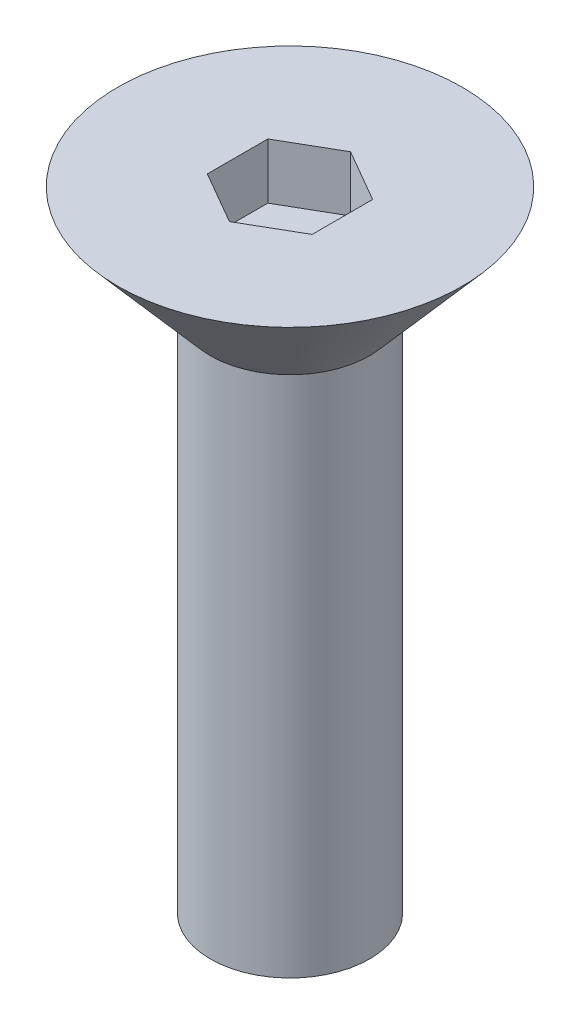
ISO-10303-21;
HEADER;
FILE_DESCRIPTION(('STEP AP214'),'2;1');
FILE_NAME('part.step','',(''),(''),'','','');
FILE_SCHEMA(('AUTOMOTIVE_DESIGN { 1 0 10303 214 1 1 1 1 }'));
ENDSEC;
DATA;
#1=APPLICATION_CONTEXT('core data for automotive mechanical design processes');
#2=APPLICATION_PROTOCOL_DEFINITION('international standard','automotive_design',2000,#1);
#3=PRODUCT_CONTEXT('',#1,'mechanical');
#4=PRODUCT('Part','Part','',(#3));
#5=PRODUCT_RELATED_PRODUCT_CATEGORY('part','',(#4));
#6=PRODUCT_DEFINITION_FORMATION('','',#4);
#7=PRODUCT_DEFINITION_CONTEXT('part definition',#1,'design');
#8=PRODUCT_DEFINITION('design','',#6,#7);
#9=PRODUCT_DEFINITION_SHAPE('','',#8);
#10=(LENGTH_UNIT() NAMED_UNIT(*) SI_UNIT(.MILLI.,.METRE.));
#11=(NAMED_UNIT(*) PLANE_ANGLE_UNIT() SI_UNIT($,.RADIAN.));
#12=(NAMED_UNIT(*) SI_UNIT($,.STERADIAN.) SOLID_ANGLE_UNIT());
#13=UNCERTAINTY_MEASURE_WITH_UNIT(LENGTH_MEASURE(1.E-05),#10,'distance_accuracy_value','');
#14=(GEOMETRIC_REPRESENTATION_CONTEXT(3) GLOBAL_UNCERTAINTY_ASSIGNED_CONTEXT((#13)) GLOBAL_UNIT_ASSIGNED_CONTEXT((#10,
#11,#12)) REPRESENTATION_CONTEXT('',''));
#15=CARTESIAN_POINT('',(0.,0.,0.));
#16=DIRECTION('',(0.,0.,1.));
#17=DIRECTION('',(1.,0.,0.));
#18=AXIS2_PLACEMENT_3D('',#15,#16,#17);
#19=CARTESIAN_POINT('',(0.,0.,0.));
#20=DIRECTION('',(0.,1.,0.));
#21=DIRECTION('',(0.,0.,1.));
#22=AXIS2_PLACEMENT_3D('',#19,#20,#21);
#23=PLANE('',#22);
#24=DIRECTION('',(0.,0.,1.));
#25=VECTOR('',#24,1.);
#26=CARTESIAN_POINT('',(-1.5875,0.,-0.916543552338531));
#27=LINE('',#26,#25);
#28=CARTESIAN_POINT('',(-1.5875,0.,-0.916543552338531));
#29=VERTEX_POINT('',#28);
#30=CARTESIAN_POINT('',(-1.5875,0.,0.91654355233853));
#31=VERTEX_POINT('',#30);
#32=EDGE_CURVE('E50',#29,#31,#27,.T.);
#33=ORIENTED_EDGE('',*,*,#32,.F.);
#34=DIRECTION('',(-0.866025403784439,0.,0.5));
#35=VECTOR('',#34,1.);
#36=CARTESIAN_POINT('',(0.,0.,-1.83308710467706));
#37=LINE('',#36,#35);
#38=CARTESIAN_POINT('',(0.,0.,-1.83308710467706));
#39=VERTEX_POINT('',#38);
#40=EDGE_CURVE('E134',#39,#29,#37,.T.);
#41=ORIENTED_EDGE('',*,*,#40,.F.);
#42=DIRECTION('',(0.866025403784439,0.,0.5));
#43=VECTOR('',#42,1.);
#44=CARTESIAN_POINT('',(0.,0.,-1.83308710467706));
#45=LINE('',#44,#43);
#46=CARTESIAN_POINT('',(1.5875,0.,-0.916543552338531));
#47=VERTEX_POINT('',#46);
#48=EDGE_CURVE('E132',#39,#47,#45,.T.);
#49=ORIENTED_EDGE('',*,*,#48,.T.);
#50=DIRECTION('',(0.,0.,1.));
#51=VECTOR('',#50,1.);
#52=CARTESIAN_POINT('',(1.5875,0.,-0.916543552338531));
#53=LINE('',#52,#51);
#54=CARTESIAN_POINT('',(1.5875,0.,0.91654355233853));
#55=VERTEX_POINT('',#54);
#56=EDGE_CURVE('E109',#47,#55,#53,.T.);
#57=ORIENTED_EDGE('',*,*,#56,.T.);
#58=DIRECTION('',(0.86602540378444,0.,-0.499999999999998));
#59=VECTOR('',#58,1.);
#60=CARTESIAN_POINT('',(0.,0.,1.83308710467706));
#61=LINE('',#60,#59);
#62=CARTESIAN_POINT('',(0.,0.,1.83308710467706));
#63=VERTEX_POINT('',#62);
#64=EDGE_CURVE('E128',#63,#55,#61,.T.);
#65=ORIENTED_EDGE('',*,*,#64,.F.);
#66=DIRECTION('',(-0.86602540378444,0.,-0.499999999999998));
#67=VECTOR('',#66,1.);
#68=CARTESIAN_POINT('',(0.,0.,1.83308710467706));
#69=LINE('',#68,#67);
#70=EDGE_CURVE('E125',#63,#31,#69,.T.);
#71=ORIENTED_EDGE('',*,*,#70,.T.);
#72=EDGE_LOOP('',(#33,#41,#49,#57,#65,#71));
#73=FACE_BOUND('',#72,.T.);
#74=CARTESIAN_POINT('',(0.,0.,0.));
#75=DIRECTION('',(0.,1.,0.));
#76=DIRECTION('',(0.,0.,1.));
#77=AXIS2_PLACEMENT_3D('',#74,#75,#76);
#78=CIRCLE('',#77,5.2197);
#79=CARTESIAN_POINT('',(0.,0.,5.2197));
#80=VERTEX_POINT('',#79);
#81=EDGE_CURVE('E11',#80,#80,#78,.T.);
#82=ORIENTED_EDGE('',*,*,#81,.T.);
#83=EDGE_LOOP('',(#82));
#84=FACE_BOUND('',#83,.T.);
#85=ADVANCED_FACE('F36',(#73,#84),#23,.T.);
#86=CARTESIAN_POINT('',(0.,-3.22873900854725,0.));
#87=DIRECTION('',(0.,1.,0.));
#88=DIRECTION('',(0.,0.,1.));
#89=AXIS2_PLACEMENT_3D('',#86,#87,#88);
#90=CONICAL_SURFACE('',#89,2.413,0.715584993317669);
#91=ORIENTED_EDGE('',*,*,#81,.F.);
#92=EDGE_LOOP('',(#91));
#93=FACE_BOUND('',#92,.T.);
#94=CARTESIAN_POINT('',(0.,-3.22873900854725,0.));
#95=DIRECTION('',(0.,1.,0.));
#96=DIRECTION('',(0.,0.,1.));
#97=AXIS2_PLACEMENT_3D('',#94,#95,#96);
#98=CIRCLE('',#97,2.413);
#99=CARTESIAN_POINT('',(0.,-3.22873900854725,2.413));
#100=VERTEX_POINT('',#99);
#101=EDGE_CURVE('E43',#100,#100,#98,.T.);
#102=ORIENTED_EDGE('',*,*,#101,.T.);
#103=EDGE_LOOP('',(#102));
#104=FACE_BOUND('',#103,.T.);
#105=ADVANCED_FACE('F148',(#93,#104),#90,.T.);
#106=CARTESIAN_POINT('',(0.,25.4,0.));
#107=DIRECTION('',(0.,1.,0.));
#108=DIRECTION('',(0.,0.,1.));
#109=AXIS2_PLACEMENT_3D('',#106,#107,#108);
#110=CYLINDRICAL_SURFACE('',#109,2.413);
#111=CARTESIAN_POINT('',(0.,-19.0529390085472,0.));
#112=DIRECTION('',(0.,1.,0.));
#113=DIRECTION('',(0.,0.,1.));
#114=AXIS2_PLACEMENT_3D('',#111,#112,#113);
#115=CIRCLE('',#114,2.41300000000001);
#116=CARTESIAN_POINT('',(0.,-19.0529390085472,2.41300000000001));
#117=VERTEX_POINT('',#116);
#118=EDGE_CURVE('E138',#117,#117,#115,.T.);
#119=ORIENTED_EDGE('',*,*,#118,.T.);
#120=EDGE_LOOP('',(#119));
#121=FACE_BOUND('',#120,.T.);
#122=ORIENTED_EDGE('',*,*,#101,.F.);
#123=EDGE_LOOP('',(#122));
#124=FACE_BOUND('',#123,.T.);
#125=ADVANCED_FACE('F150',(#121,#124),#110,.T.);
#126=CARTESIAN_POINT('',(2.41300000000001,-19.0529390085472,0.));
#127=DIRECTION('',(0.,-1.,0.));
#128=DIRECTION('',(0.,0.,-1.));
#129=AXIS2_PLACEMENT_3D('',#126,#127,#128);
#130=PLANE('',#129);
#131=ORIENTED_EDGE('',*,*,#118,.F.);
#132=EDGE_LOOP('',(#131));
#133=FACE_BOUND('',#132,.T.);
#134=ADVANCED_FACE('F152',(#133),#130,.T.);
#135=CARTESIAN_POINT('',(-1.5875,-1.68402,-0.916543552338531));
#136=DIRECTION('',(-1.,0.,0.));
#137=DIRECTION('',(0.,0.,1.));
#138=AXIS2_PLACEMENT_3D('',#135,#136,#137);
#139=PLANE('',#138);
#140=ORIENTED_EDGE('',*,*,#32,.T.);
#141=DIRECTION('',(0.,1.,0.));
#142=VECTOR('',#141,1.);
#143=CARTESIAN_POINT('',(-1.5875,-1.68402,0.91654355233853));
#144=LINE('',#143,#142);
#145=CARTESIAN_POINT('',(-1.5875,-1.68402,0.91654355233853));
#146=VERTEX_POINT('',#145);
#147=EDGE_CURVE('E123',#146,#31,#144,.T.);
#148=ORIENTED_EDGE('',*,*,#147,.F.);
#149=DIRECTION('',(0.,0.,1.));
#150=VECTOR('',#149,1.);
#151=CARTESIAN_POINT('',(-1.5875,-1.68402,-0.916543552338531));
#152=LINE('',#151,#150);
#153=CARTESIAN_POINT('',(-1.5875,-1.68402,-0.916543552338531));
#154=VERTEX_POINT('',#153);
#155=EDGE_CURVE('E136',#154,#146,#152,.T.);
#156=ORIENTED_EDGE('',*,*,#155,.F.);
#157=DIRECTION('',(0.,1.,0.));
#158=VECTOR('',#157,1.);
#159=CARTESIAN_POINT('',(-1.5875,-1.68402,-0.916543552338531));
#160=LINE('',#159,#158);
#161=EDGE_CURVE('E58',#154,#29,#160,.T.);
#162=ORIENTED_EDGE('',*,*,#161,.T.);
#163=EDGE_LOOP('',(#140,#148,#156,#162));
#164=FACE_BOUND('',#163,.T.);
#165=ADVANCED_FACE('F159',(#164),#139,.F.);
#166=CARTESIAN_POINT('',(0.,-1.68402,-1.83308710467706));
#167=DIRECTION('',(-0.5,0.,-0.866025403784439));
#168=DIRECTION('',(-0.866025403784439,0.,0.5));
#169=AXIS2_PLACEMENT_3D('',#166,#167,#168);
#170=PLANE('',#169);
#171=ORIENTED_EDGE('',*,*,#40,.T.);
#172=ORIENTED_EDGE('',*,*,#161,.F.);
#173=DIRECTION('',(-0.866025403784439,0.,0.5));
#174=VECTOR('',#173,1.);
#175=CARTESIAN_POINT('',(0.,-1.68402,-1.83308710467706));
#176=LINE('',#175,#174);
#177=CARTESIAN_POINT('',(0.,-1.68402,-1.83308710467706));
#178=VERTEX_POINT('',#177);
#179=EDGE_CURVE('E102',#178,#154,#176,.T.);
#180=ORIENTED_EDGE('',*,*,#179,.F.);
#181=DIRECTION('',(0.,1.,0.));
#182=VECTOR('',#181,1.);
#183=CARTESIAN_POINT('',(0.,-1.68402,-1.83308710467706));
#184=LINE('',#183,#182);
#185=EDGE_CURVE('E98',#178,#39,#184,.T.);
#186=ORIENTED_EDGE('',*,*,#185,.T.);
#187=EDGE_LOOP('',(#171,#172,#180,#186));
#188=FACE_BOUND('',#187,.T.);
#189=ADVANCED_FACE('F174',(#188),#170,.F.);
#190=CARTESIAN_POINT('',(0.,-1.68402,-1.83308710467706));
#191=DIRECTION('',(-0.5,0.,0.866025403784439));
#192=DIRECTION('',(0.866025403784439,0.,0.5));
#193=AXIS2_PLACEMENT_3D('',#190,#191,#192);
#194=PLANE('',#193);
#195=ORIENTED_EDGE('',*,*,#48,.F.);
#196=ORIENTED_EDGE('',*,*,#185,.F.);
#197=DIRECTION('',(0.866025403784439,0.,0.5));
#198=VECTOR('',#197,1.);
#199=CARTESIAN_POINT('',(0.,-1.68402,-1.83308710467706));
#200=LINE('',#199,#198);
#201=CARTESIAN_POINT('',(1.5875,-1.68402,-0.916543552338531));
#202=VERTEX_POINT('',#201);
#203=EDGE_CURVE('E92',#178,#202,#200,.T.);
#204=ORIENTED_EDGE('',*,*,#203,.T.);
#205=DIRECTION('',(0.,1.,0.));
#206=VECTOR('',#205,1.);
#207=CARTESIAN_POINT('',(1.5875,-1.68402,-0.916543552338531));
#208=LINE('',#207,#206);
#209=EDGE_CURVE('E96',#202,#47,#208,.T.);
#210=ORIENTED_EDGE('',*,*,#209,.T.);
#211=EDGE_LOOP('',(#195,#196,#204,#210));
#212=FACE_BOUND('',#211,.T.);
#213=ADVANCED_FACE('F95',(#212),#194,.T.);
#214=CARTESIAN_POINT('',(1.5875,-1.68402,-0.916543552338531));
#215=DIRECTION('',(-1.,0.,0.));
#216=DIRECTION('',(0.,0.,1.));
#217=AXIS2_PLACEMENT_3D('',#214,#215,#216);
#218=PLANE('',#217);
#219=ORIENTED_EDGE('',*,*,#56,.F.);
#220=ORIENTED_EDGE('',*,*,#209,.F.);
#221=DIRECTION('',(0.,0.,1.));
#222=VECTOR('',#221,1.);
#223=CARTESIAN_POINT('',(1.5875,-1.68402,-0.916543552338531));
#224=LINE('',#223,#222);
#225=CARTESIAN_POINT('',(1.5875,-1.68402,0.91654355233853));
#226=VERTEX_POINT('',#225);
#227=EDGE_CURVE('E103',#202,#226,#224,.T.);
#228=ORIENTED_EDGE('',*,*,#227,.T.);
#229=DIRECTION('',(0.,1.,0.));
#230=VECTOR('',#229,1.);
#231=CARTESIAN_POINT('',(1.5875,-1.68402,0.91654355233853));
#232=LINE('',#231,#230);
#233=EDGE_CURVE('E111',#226,#55,#232,.T.);
#234=ORIENTED_EDGE('',*,*,#233,.T.);
#235=EDGE_LOOP('',(#219,#220,#228,#234));
#236=FACE_BOUND('',#235,.T.);
#237=ADVANCED_FACE('F106',(#236),#218,.T.);
#238=CARTESIAN_POINT('',(0.,-1.68402,1.83308710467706));
#239=DIRECTION('',(0.499999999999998,0.,0.86602540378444));
#240=DIRECTION('',(0.86602540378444,0.,-0.499999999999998));
#241=AXIS2_PLACEMENT_3D('',#238,#239,#240);
#242=PLANE('',#241);
#243=ORIENTED_EDGE('',*,*,#64,.T.);
#244=ORIENTED_EDGE('',*,*,#233,.F.);
#245=DIRECTION('',(0.86602540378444,0.,-0.499999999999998));
#246=VECTOR('',#245,1.);
#247=CARTESIAN_POINT('',(0.,-1.68402,1.83308710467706));
#248=LINE('',#247,#246);
#249=CARTESIAN_POINT('',(0.,-1.68402,1.83308710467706));
#250=VERTEX_POINT('',#249);
#251=EDGE_CURVE('E117',#250,#226,#248,.T.);
#252=ORIENTED_EDGE('',*,*,#251,.F.);
#253=DIRECTION('',(0.,1.,0.));
#254=VECTOR('',#253,1.);
#255=CARTESIAN_POINT('',(0.,-1.68402,1.83308710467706));
#256=LINE('',#255,#254);
#257=EDGE_CURVE('E141',#250,#63,#256,.T.);
#258=ORIENTED_EDGE('',*,*,#257,.T.);
#259=EDGE_LOOP('',(#243,#244,#252,#258));
#260=FACE_BOUND('',#259,.T.);
#261=ADVANCED_FACE('F187',(#260),#242,.F.);
#262=CARTESIAN_POINT('',(0.,-1.68402,1.83308710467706));
#263=DIRECTION('',(0.499999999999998,0.,-0.86602540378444));
#264=DIRECTION('',(-0.86602540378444,0.,-0.499999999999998));
#265=AXIS2_PLACEMENT_3D('',#262,#263,#264);
#266=PLANE('',#265);
#267=ORIENTED_EDGE('',*,*,#70,.F.);
#268=ORIENTED_EDGE('',*,*,#257,.F.);
#269=DIRECTION('',(-0.86602540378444,0.,-0.499999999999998));
#270=VECTOR('',#269,1.);
#271=CARTESIAN_POINT('',(0.,-1.68402,1.83308710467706));
#272=LINE('',#271,#270);
#273=EDGE_CURVE('E84',#250,#146,#272,.T.);
#274=ORIENTED_EDGE('',*,*,#273,.T.);
#275=ORIENTED_EDGE('',*,*,#147,.T.);
#276=EDGE_LOOP('',(#267,#268,#274,#275));
#277=FACE_BOUND('',#276,.T.);
#278=ADVANCED_FACE('F172',(#277),#266,.T.);
#279=CARTESIAN_POINT('',(-1.5875,-1.68402,0.91654355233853));
#280=DIRECTION('',(0.,-1.,0.));
#281=DIRECTION('',(0.,0.,-1.));
#282=AXIS2_PLACEMENT_3D('',#279,#280,#281);
#283=PLANE('',#282);
#284=ORIENTED_EDGE('',*,*,#155,.T.);
#285=ORIENTED_EDGE('',*,*,#273,.F.);
#286=ORIENTED_EDGE('',*,*,#251,.T.);
#287=ORIENTED_EDGE('',*,*,#227,.F.);
#288=ORIENTED_EDGE('',*,*,#203,.F.);
#289=ORIENTED_EDGE('',*,*,#179,.T.);
#290=EDGE_LOOP('',(#284,#285,#286,#287,#288,#289));
#291=FACE_BOUND('',#290,.T.);
#292=ADVANCED_FACE('F115',(#291),#283,.F.);
#293=CLOSED_SHELL('',(#85,#105,#125,#134,#165,#189,#213,#237,#261,#278,#292));
#294=MANIFOLD_SOLID_BREP('B2',#293);
#295=ADVANCED_BREP_SHAPE_REPRESENTATION('',(#18,#294),#14);
#296=SHAPE_DEFINITION_REPRESENTATION(#9,#295);
ENDSEC;
END-ISO-10303-21;
